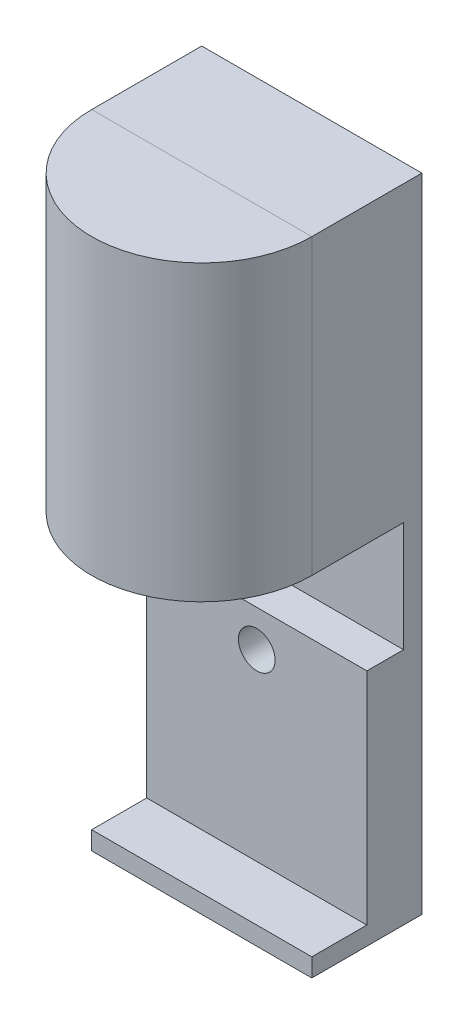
from build123d import *

# Parameters (mm, degrees)
SKETCH1_W           = 60
SKETCH1_H           = 160
REVOLVE1_ANGLE      = 180
SKETCH3_W           = 120
SKETCH3_H           = 350
BOSS_EXTRUDE1_DEPTH = 60
SKETCH5_W           = 50
SKETCH5_H           = 150
SKETCH6_W           = 120
SKETCH6_H           = 180
CUT_EXTRUDE1_DEPTH  = 50
SKETCH8_W           = 120
SKETCH8_H           = 120
BOSS_EXTRUDE2_DEPTH = 30
SKETCH9_R           = 10
CUT_EXTRUDE2_DEPTH  = 70


with BuildPart() as part:
    # Sketch1 → Revolve1 (revolve)
    with BuildSketch(Plane.XY):
        with Locations((30, 80)):
            Rectangle(SKETCH1_W, SKETCH1_H)
    revolve(axis=Axis((0, 0, 0), (0, -1, 0)), revolution_arc=REVOLVE1_ANGLE)


with BuildPart() as body_2:
    # Sketch3 → Boss-Extrude1 (new body)
    with BuildSketch(Plane.XY):
        with Locations((0, -15)):
            Rectangle(SKETCH3_W, SKETCH3_H)
    extrude(amount=-BOSS_EXTRUDE1_DEPTH)


with BuildPart() as cut_revolve2_tool:
    # Sketch5 → Cut-Revolve2 (revolve)
    with BuildSketch(Plane.XY):
        with Locations((25, 75)):
            Rectangle(SKETCH5_W, SKETCH5_H)
    revolve(axis=Axis((0, 0, 0), (0, 1, 0)))


with BuildPart() as part_1:
    add(part.part)

    # Cut-Revolve2: cut by cut_revolve2_tool
    add(cut_revolve2_tool.part, mode=Mode.SUBTRACT)


with BuildPart() as body_2_1:
    add(body_2.part)

    # Cut-Revolve2: cut by cut_revolve2_tool
    add(cut_revolve2_tool.part, mode=Mode.SUBTRACT)

    # Sketch6 → Cut-Extrude1 (cut)
    with BuildSketch(Plane.XY):
        with Locations((0, -90)):
            Rectangle(SKETCH6_W, SKETCH6_H)
    extrude(amount=-CUT_EXTRUDE1_DEPTH, mode=Mode.SUBTRACT)

    # Sketch8 → Boss-Extrude2 (add)
    with BuildSketch(Plane.XY.offset(-30)):
        with Locations((0, -120)):
            Rectangle(SKETCH8_W, SKETCH8_H)
    extrude(amount=-BOSS_EXTRUDE2_DEPTH)

    # Sketch9 → Cut-Extrude2 (cut)
    with BuildSketch(Plane.XY):
        with Locations((0, -80)):
            Circle(SKETCH9_R)
    extrude(amount=-CUT_EXTRUDE2_DEPTH, mode=Mode.SUBTRACT)


solid = Compound([part_1.part, body_2_1.part])
